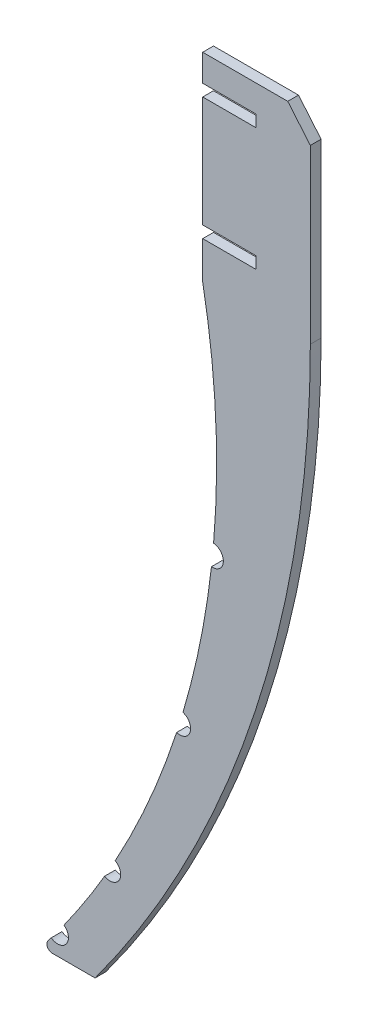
ISO-10303-21;
HEADER;
FILE_DESCRIPTION(('STEP AP214'),'2;1');
FILE_NAME('part.step','',(''),(''),'','','');
FILE_SCHEMA(('AUTOMOTIVE_DESIGN { 1 0 10303 214 1 1 1 1 }'));
ENDSEC;
DATA;
#1=APPLICATION_CONTEXT('core data for automotive mechanical design processes');
#2=APPLICATION_PROTOCOL_DEFINITION('international standard','automotive_design',2000,#1);
#3=PRODUCT_CONTEXT('',#1,'mechanical');
#4=PRODUCT('Part','Part','',(#3));
#5=PRODUCT_RELATED_PRODUCT_CATEGORY('part','',(#4));
#6=PRODUCT_DEFINITION_FORMATION('','',#4);
#7=PRODUCT_DEFINITION_CONTEXT('part definition',#1,'design');
#8=PRODUCT_DEFINITION('design','',#6,#7);
#9=PRODUCT_DEFINITION_SHAPE('','',#8);
#10=(LENGTH_UNIT() NAMED_UNIT(*) SI_UNIT(.MILLI.,.METRE.));
#11=(NAMED_UNIT(*) PLANE_ANGLE_UNIT() SI_UNIT($,.RADIAN.));
#12=(NAMED_UNIT(*) SI_UNIT($,.STERADIAN.) SOLID_ANGLE_UNIT());
#13=UNCERTAINTY_MEASURE_WITH_UNIT(LENGTH_MEASURE(1.E-05),#10,'distance_accuracy_value','');
#14=(GEOMETRIC_REPRESENTATION_CONTEXT(3) GLOBAL_UNCERTAINTY_ASSIGNED_CONTEXT((#13)) GLOBAL_UNIT_ASSIGNED_CONTEXT((#10,
#11,#12)) REPRESENTATION_CONTEXT('',''));
#15=CARTESIAN_POINT('',(0.,0.,0.));
#16=DIRECTION('',(0.,0.,1.));
#17=DIRECTION('',(1.,0.,0.));
#18=AXIS2_PLACEMENT_3D('',#15,#16,#17);
#19=CARTESIAN_POINT('',(-19.9999999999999,-156.8,1.5));
#20=DIRECTION('',(0.,1.,0.));
#21=DIRECTION('',(1.,0.,0.));
#22=AXIS2_PLACEMENT_3D('',#19,#20,#21);
#23=PLANE('',#22);
#24=DIRECTION('',(0.,0.,1.));
#25=VECTOR('',#24,1.);
#26=CARTESIAN_POINT('',(-27.9577727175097,-156.8,1.5));
#27=LINE('',#26,#25);
#28=CARTESIAN_POINT('',(-27.9577727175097,-156.8,-0.5));
#29=VERTEX_POINT('',#28);
#30=CARTESIAN_POINT('',(-27.9577727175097,-156.8,1.5));
#31=VERTEX_POINT('',#30);
#32=EDGE_CURVE('E11',#29,#31,#27,.T.);
#33=ORIENTED_EDGE('',*,*,#32,.F.);
#34=DIRECTION('',(-1.,0.,0.));
#35=VECTOR('',#34,1.);
#36=CARTESIAN_POINT('',(-186.05,-156.8,-0.5));
#37=LINE('',#36,#35);
#38=CARTESIAN_POINT('',(-19.9999999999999,-156.8,-0.5));
#39=VERTEX_POINT('',#38);
#40=EDGE_CURVE('E149',#29,#39,#37,.F.);
#41=ORIENTED_EDGE('',*,*,#40,.T.);
#42=DIRECTION('',(0.,0.,1.));
#43=VECTOR('',#42,1.);
#44=CARTESIAN_POINT('',(-19.9999999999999,-156.8,1.5));
#45=LINE('',#44,#43);
#46=CARTESIAN_POINT('',(-19.9999999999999,-156.8,1.5));
#47=VERTEX_POINT('',#46);
#48=EDGE_CURVE('E44',#39,#47,#45,.T.);
#49=ORIENTED_EDGE('',*,*,#48,.T.);
#50=DIRECTION('',(1.,0.,0.));
#51=VECTOR('',#50,1.);
#52=CARTESIAN_POINT('',(-19.9999999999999,-156.8,1.5));
#53=LINE('',#52,#51);
#54=EDGE_CURVE('E284',#31,#47,#53,.T.);
#55=ORIENTED_EDGE('',*,*,#54,.F.);
#56=EDGE_LOOP('',(#33,#41,#49,#55));
#57=FACE_BOUND('',#56,.T.);
#58=ADVANCED_FACE('F34',(#57),#23,.F.);
#59=CARTESIAN_POINT('',(-186.05,-34.8000000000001,1.5));
#60=DIRECTION('',(0.,0.,1.));
#61=DIRECTION('',(1.,0.,0.));
#62=AXIS2_PLACEMENT_3D('',#59,#60,#61);
#63=CYLINDRICAL_SURFACE('',#62,206.05);
#64=ORIENTED_EDGE('',*,*,#48,.F.);
#65=CARTESIAN_POINT('',(-186.05,-34.8000000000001,-0.5));
#66=DIRECTION('',(0.,0.,1.));
#67=DIRECTION('',(1.,0.,0.));
#68=AXIS2_PLACEMENT_3D('',#65,#66,#67);
#69=CIRCLE('',#68,206.05);
#70=CARTESIAN_POINT('',(20.,-34.8,-0.5));
#71=VERTEX_POINT('',#70);
#72=EDGE_CURVE('E216',#39,#71,#69,.T.);
#73=ORIENTED_EDGE('',*,*,#72,.T.);
#74=DIRECTION('',(0.,0.,1.));
#75=VECTOR('',#74,1.);
#76=CARTESIAN_POINT('',(20.,-34.8,1.5));
#77=LINE('',#76,#75);
#78=CARTESIAN_POINT('',(20.,-34.8,1.5));
#79=VERTEX_POINT('',#78);
#80=EDGE_CURVE('E277',#71,#79,#77,.T.);
#81=ORIENTED_EDGE('',*,*,#80,.T.);
#82=CARTESIAN_POINT('',(-186.05,-34.8000000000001,1.5));
#83=DIRECTION('',(0.,0.,1.));
#84=DIRECTION('',(-1.,0.,0.));
#85=AXIS2_PLACEMENT_3D('',#82,#83,#84);
#86=CIRCLE('',#85,206.05);
#87=EDGE_CURVE('E293',#47,#79,#86,.T.);
#88=ORIENTED_EDGE('',*,*,#87,.F.);
#89=EDGE_LOOP('',(#64,#73,#81,#88));
#90=FACE_BOUND('',#89,.T.);
#91=ADVANCED_FACE('F296',(#90),#63,.T.);
#92=CARTESIAN_POINT('',(20.,2.2,1.5));
#93=DIRECTION('',(-1.,0.,0.));
#94=DIRECTION('',(0.,1.,0.));
#95=AXIS2_PLACEMENT_3D('',#92,#93,#94);
#96=PLANE('',#95);
#97=ORIENTED_EDGE('',*,*,#80,.F.);
#98=DIRECTION('',(0.,1.,0.));
#99=VECTOR('',#98,1.);
#100=CARTESIAN_POINT('',(20.,-34.8000000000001,-0.5));
#101=LINE('',#100,#99);
#102=CARTESIAN_POINT('',(20.,-2.80000000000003,-0.5));
#103=VERTEX_POINT('',#102);
#104=EDGE_CURVE('E213',#71,#103,#101,.T.);
#105=ORIENTED_EDGE('',*,*,#104,.T.);
#106=DIRECTION('',(0.,0.,1.));
#107=VECTOR('',#106,1.);
#108=CARTESIAN_POINT('',(20.,-2.80000000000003,1.5));
#109=LINE('',#108,#107);
#110=CARTESIAN_POINT('',(20.,-2.80000000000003,1.5));
#111=VERTEX_POINT('',#110);
#112=EDGE_CURVE('E274',#103,#111,#109,.T.);
#113=ORIENTED_EDGE('',*,*,#112,.T.);
#114=DIRECTION('',(0.,1.,0.));
#115=VECTOR('',#114,1.);
#116=CARTESIAN_POINT('',(20.,2.2,1.5));
#117=LINE('',#116,#115);
#118=EDGE_CURVE('E297',#79,#111,#117,.T.);
#119=ORIENTED_EDGE('',*,*,#118,.F.);
#120=EDGE_LOOP('',(#97,#105,#113,#119));
#121=FACE_BOUND('',#120,.T.);
#122=ADVANCED_FACE('F464',(#121),#96,.F.);
#123=CARTESIAN_POINT('',(15.8045018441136,2.2,1.5));
#124=DIRECTION('',(0.76604444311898,0.642787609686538,0.));
#125=DIRECTION('',(0.642787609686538,-0.76604444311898,0.));
#126=AXIS2_PLACEMENT_3D('',#123,#124,#125);
#127=PLANE('',#126);
#128=ORIENTED_EDGE('',*,*,#112,.F.);
#129=DIRECTION('',(0.642787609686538,-0.76604444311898,0.));
#130=VECTOR('',#129,1.);
#131=CARTESIAN_POINT('',(15.8045018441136,2.2,-0.5));
#132=LINE('',#131,#130);
#133=CARTESIAN_POINT('',(15.8045018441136,2.2,-0.5));
#134=VERTEX_POINT('',#133);
#135=EDGE_CURVE('E210',#103,#134,#132,.F.);
#136=ORIENTED_EDGE('',*,*,#135,.T.);
#137=DIRECTION('',(0.,0.,1.));
#138=VECTOR('',#137,1.);
#139=CARTESIAN_POINT('',(15.8045018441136,2.2,1.5));
#140=LINE('',#139,#138);
#141=CARTESIAN_POINT('',(15.8045018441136,2.2,1.5));
#142=VERTEX_POINT('',#141);
#143=EDGE_CURVE('E271',#134,#142,#140,.T.);
#144=ORIENTED_EDGE('',*,*,#143,.T.);
#145=DIRECTION('',(0.642787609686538,-0.76604444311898,0.));
#146=VECTOR('',#145,1.);
#147=CARTESIAN_POINT('',(15.8045018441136,2.2,1.5));
#148=LINE('',#147,#146);
#149=EDGE_CURVE('E299',#111,#142,#148,.F.);
#150=ORIENTED_EDGE('',*,*,#149,.F.);
#151=EDGE_LOOP('',(#128,#136,#144,#150));
#152=FACE_BOUND('',#151,.T.);
#153=ADVANCED_FACE('F460',(#152),#127,.T.);
#154=CARTESIAN_POINT('',(0.,2.2,1.5));
#155=DIRECTION('',(0.,-1.,0.));
#156=DIRECTION('',(-1.,0.,0.));
#157=AXIS2_PLACEMENT_3D('',#154,#155,#156);
#158=PLANE('',#157);
#159=ORIENTED_EDGE('',*,*,#143,.F.);
#160=DIRECTION('',(-1.,0.,0.));
#161=VECTOR('',#160,1.);
#162=CARTESIAN_POINT('',(-186.05,2.2,-0.5));
#163=LINE('',#162,#161);
#164=CARTESIAN_POINT('',(0.,2.2,-0.5));
#165=VERTEX_POINT('',#164);
#166=EDGE_CURVE('E207',#134,#165,#163,.T.);
#167=ORIENTED_EDGE('',*,*,#166,.T.);
#168=DIRECTION('',(0.,0.,1.));
#169=VECTOR('',#168,1.);
#170=CARTESIAN_POINT('',(0.,2.2,1.5));
#171=LINE('',#170,#169);
#172=CARTESIAN_POINT('',(0.,2.2,1.5));
#173=VERTEX_POINT('',#172);
#174=EDGE_CURVE('E268',#165,#173,#171,.T.);
#175=ORIENTED_EDGE('',*,*,#174,.T.);
#176=DIRECTION('',(-1.,0.,0.));
#177=VECTOR('',#176,1.);
#178=CARTESIAN_POINT('',(0.,2.2,1.5));
#179=LINE('',#178,#177);
#180=EDGE_CURVE('E305',#142,#173,#179,.T.);
#181=ORIENTED_EDGE('',*,*,#180,.F.);
#182=EDGE_LOOP('',(#159,#167,#175,#181));
#183=FACE_BOUND('',#182,.T.);
#184=ADVANCED_FACE('F457',(#183),#158,.F.);
#185=CARTESIAN_POINT('',(0.,-2.8,1.5));
#186=DIRECTION('',(1.,0.,0.));
#187=DIRECTION('',(0.,-1.,0.));
#188=AXIS2_PLACEMENT_3D('',#185,#186,#187);
#189=PLANE('',#188);
#190=ORIENTED_EDGE('',*,*,#174,.F.);
#191=DIRECTION('',(0.,1.,0.));
#192=VECTOR('',#191,1.);
#193=CARTESIAN_POINT('',(0.,-34.8000000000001,-0.5));
#194=LINE('',#193,#192);
#195=CARTESIAN_POINT('',(0.,-2.8,-0.5));
#196=VERTEX_POINT('',#195);
#197=EDGE_CURVE('E204',#165,#196,#194,.F.);
#198=ORIENTED_EDGE('',*,*,#197,.T.);
#199=DIRECTION('',(0.,0.,1.));
#200=VECTOR('',#199,1.);
#201=CARTESIAN_POINT('',(0.,-2.8,1.5));
#202=LINE('',#201,#200);
#203=CARTESIAN_POINT('',(0.,-2.8,1.5));
#204=VERTEX_POINT('',#203);
#205=EDGE_CURVE('E265',#196,#204,#202,.T.);
#206=ORIENTED_EDGE('',*,*,#205,.T.);
#207=DIRECTION('',(0.,-1.,0.));
#208=VECTOR('',#207,1.);
#209=CARTESIAN_POINT('',(0.,-2.8,1.5));
#210=LINE('',#209,#208);
#211=EDGE_CURVE('E308',#173,#204,#210,.T.);
#212=ORIENTED_EDGE('',*,*,#211,.F.);
#213=EDGE_LOOP('',(#190,#198,#206,#212));
#214=FACE_BOUND('',#213,.T.);
#215=ADVANCED_FACE('F454',(#214),#189,.F.);
#216=CARTESIAN_POINT('',(0.,-2.8,1.5));
#217=DIRECTION('',(0.,1.,0.));
#218=DIRECTION('',(1.,0.,0.));
#219=AXIS2_PLACEMENT_3D('',#216,#217,#218);
#220=PLANE('',#219);
#221=ORIENTED_EDGE('',*,*,#205,.F.);
#222=DIRECTION('',(-1.,0.,0.));
#223=VECTOR('',#222,1.);
#224=CARTESIAN_POINT('',(-186.05,-2.8,-0.5));
#225=LINE('',#224,#223);
#226=CARTESIAN_POINT('',(9.91,-2.8,-0.5));
#227=VERTEX_POINT('',#226);
#228=EDGE_CURVE('E201',#196,#227,#225,.F.);
#229=ORIENTED_EDGE('',*,*,#228,.T.);
#230=DIRECTION('',(0.,0.,1.));
#231=VECTOR('',#230,1.);
#232=CARTESIAN_POINT('',(9.91,-2.8,1.5));
#233=LINE('',#232,#231);
#234=CARTESIAN_POINT('',(9.91,-2.8,1.5));
#235=VERTEX_POINT('',#234);
#236=EDGE_CURVE('E262',#227,#235,#233,.T.);
#237=ORIENTED_EDGE('',*,*,#236,.T.);
#238=DIRECTION('',(1.,0.,0.));
#239=VECTOR('',#238,1.);
#240=CARTESIAN_POINT('',(0.,-2.8,1.5));
#241=LINE('',#240,#239);
#242=EDGE_CURVE('E311',#204,#235,#241,.T.);
#243=ORIENTED_EDGE('',*,*,#242,.F.);
#244=EDGE_LOOP('',(#221,#229,#237,#243));
#245=FACE_BOUND('',#244,.T.);
#246=ADVANCED_FACE('F449',(#245),#220,.F.);
#247=CARTESIAN_POINT('',(9.91,-2.8,1.5));
#248=DIRECTION('',(1.,0.,0.));
#249=DIRECTION('',(0.,-1.,0.));
#250=AXIS2_PLACEMENT_3D('',#247,#248,#249);
#251=PLANE('',#250);
#252=ORIENTED_EDGE('',*,*,#236,.F.);
#253=DIRECTION('',(0.,1.,0.));
#254=VECTOR('',#253,1.);
#255=CARTESIAN_POINT('',(9.91,-34.8000000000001,-0.5));
#256=LINE('',#255,#254);
#257=CARTESIAN_POINT('',(9.91,-5.,-0.5));
#258=VERTEX_POINT('',#257);
#259=EDGE_CURVE('E198',#227,#258,#256,.F.);
#260=ORIENTED_EDGE('',*,*,#259,.T.);
#261=DIRECTION('',(0.,0.,1.));
#262=VECTOR('',#261,1.);
#263=CARTESIAN_POINT('',(9.91,-5.,1.5));
#264=LINE('',#263,#262);
#265=CARTESIAN_POINT('',(9.91,-5.,1.5));
#266=VERTEX_POINT('',#265);
#267=EDGE_CURVE('E259',#258,#266,#264,.T.);
#268=ORIENTED_EDGE('',*,*,#267,.T.);
#269=DIRECTION('',(0.,-1.,0.));
#270=VECTOR('',#269,1.);
#271=CARTESIAN_POINT('',(9.91,-2.8,1.5));
#272=LINE('',#271,#270);
#273=EDGE_CURVE('E314',#235,#266,#272,.T.);
#274=ORIENTED_EDGE('',*,*,#273,.F.);
#275=EDGE_LOOP('',(#252,#260,#268,#274));
#276=FACE_BOUND('',#275,.T.);
#277=ADVANCED_FACE('F445',(#276),#251,.F.);
#278=CARTESIAN_POINT('',(0.,-5.,1.5));
#279=DIRECTION('',(0.,-1.,0.));
#280=DIRECTION('',(-1.,0.,0.));
#281=AXIS2_PLACEMENT_3D('',#278,#279,#280);
#282=PLANE('',#281);
#283=ORIENTED_EDGE('',*,*,#267,.F.);
#284=DIRECTION('',(-1.,0.,0.));
#285=VECTOR('',#284,1.);
#286=CARTESIAN_POINT('',(-186.05,-5.,-0.5));
#287=LINE('',#286,#285);
#288=CARTESIAN_POINT('',(0.,-5.,-0.5));
#289=VERTEX_POINT('',#288);
#290=EDGE_CURVE('E195',#258,#289,#287,.T.);
#291=ORIENTED_EDGE('',*,*,#290,.T.);
#292=DIRECTION('',(0.,0.,1.));
#293=VECTOR('',#292,1.);
#294=CARTESIAN_POINT('',(0.,-5.,1.5));
#295=LINE('',#294,#293);
#296=CARTESIAN_POINT('',(0.,-5.,1.5));
#297=VERTEX_POINT('',#296);
#298=EDGE_CURVE('E256',#289,#297,#295,.T.);
#299=ORIENTED_EDGE('',*,*,#298,.T.);
#300=DIRECTION('',(-1.,0.,0.));
#301=VECTOR('',#300,1.);
#302=CARTESIAN_POINT('',(0.,-5.,1.5));
#303=LINE('',#302,#301);
#304=EDGE_CURVE('E317',#266,#297,#303,.T.);
#305=ORIENTED_EDGE('',*,*,#304,.F.);
#306=EDGE_LOOP('',(#283,#291,#299,#305));
#307=FACE_BOUND('',#306,.T.);
#308=ADVANCED_FACE('F442',(#307),#282,.F.);
#309=CARTESIAN_POINT('',(0.,-5.,1.5));
#310=DIRECTION('',(1.,0.,0.));
#311=DIRECTION('',(0.,-1.,0.));
#312=AXIS2_PLACEMENT_3D('',#309,#310,#311);
#313=PLANE('',#312);
#314=ORIENTED_EDGE('',*,*,#298,.F.);
#315=DIRECTION('',(0.,1.,0.));
#316=VECTOR('',#315,1.);
#317=CARTESIAN_POINT('',(0.,-34.8000000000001,-0.5));
#318=LINE('',#317,#316);
#319=CARTESIAN_POINT('',(0.,-25.6,-0.5));
#320=VERTEX_POINT('',#319);
#321=EDGE_CURVE('E192',#289,#320,#318,.F.);
#322=ORIENTED_EDGE('',*,*,#321,.T.);
#323=DIRECTION('',(0.,0.,1.));
#324=VECTOR('',#323,1.);
#325=CARTESIAN_POINT('',(0.,-25.6,1.5));
#326=LINE('',#325,#324);
#327=CARTESIAN_POINT('',(0.,-25.6,1.5));
#328=VERTEX_POINT('',#327);
#329=EDGE_CURVE('E253',#320,#328,#326,.T.);
#330=ORIENTED_EDGE('',*,*,#329,.T.);
#331=DIRECTION('',(0.,-1.,0.));
#332=VECTOR('',#331,1.);
#333=CARTESIAN_POINT('',(0.,-5.,1.5));
#334=LINE('',#333,#332);
#335=EDGE_CURVE('E320',#297,#328,#334,.T.);
#336=ORIENTED_EDGE('',*,*,#335,.F.);
#337=EDGE_LOOP('',(#314,#322,#330,#336));
#338=FACE_BOUND('',#337,.T.);
#339=ADVANCED_FACE('F437',(#338),#313,.F.);
#340=CARTESIAN_POINT('',(0.,-25.6,1.5));
#341=DIRECTION('',(0.,1.,0.));
#342=DIRECTION('',(1.,0.,0.));
#343=AXIS2_PLACEMENT_3D('',#340,#341,#342);
#344=PLANE('',#343);
#345=ORIENTED_EDGE('',*,*,#329,.F.);
#346=DIRECTION('',(-1.,0.,0.));
#347=VECTOR('',#346,1.);
#348=CARTESIAN_POINT('',(-186.05,-25.6,-0.5));
#349=LINE('',#348,#347);
#350=CARTESIAN_POINT('',(9.91,-25.6,-0.5));
#351=VERTEX_POINT('',#350);
#352=EDGE_CURVE('E189',#320,#351,#349,.F.);
#353=ORIENTED_EDGE('',*,*,#352,.T.);
#354=DIRECTION('',(0.,0.,1.));
#355=VECTOR('',#354,1.);
#356=CARTESIAN_POINT('',(9.91,-25.6,1.5));
#357=LINE('',#356,#355);
#358=CARTESIAN_POINT('',(9.91,-25.6,1.5));
#359=VERTEX_POINT('',#358);
#360=EDGE_CURVE('E250',#351,#359,#357,.T.);
#361=ORIENTED_EDGE('',*,*,#360,.T.);
#362=DIRECTION('',(1.,0.,0.));
#363=VECTOR('',#362,1.);
#364=CARTESIAN_POINT('',(0.,-25.6,1.5));
#365=LINE('',#364,#363);
#366=EDGE_CURVE('E323',#328,#359,#365,.T.);
#367=ORIENTED_EDGE('',*,*,#366,.F.);
#368=EDGE_LOOP('',(#345,#353,#361,#367));
#369=FACE_BOUND('',#368,.T.);
#370=ADVANCED_FACE('F433',(#369),#344,.F.);
#371=CARTESIAN_POINT('',(9.91,-25.6,1.5));
#372=DIRECTION('',(1.,0.,0.));
#373=DIRECTION('',(0.,-1.,0.));
#374=AXIS2_PLACEMENT_3D('',#371,#372,#373);
#375=PLANE('',#374);
#376=ORIENTED_EDGE('',*,*,#360,.F.);
#377=DIRECTION('',(0.,1.,0.));
#378=VECTOR('',#377,1.);
#379=CARTESIAN_POINT('',(9.91,-34.8000000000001,-0.5));
#380=LINE('',#379,#378);
#381=CARTESIAN_POINT('',(9.91,-27.8,-0.5));
#382=VERTEX_POINT('',#381);
#383=EDGE_CURVE('E186',#351,#382,#380,.F.);
#384=ORIENTED_EDGE('',*,*,#383,.T.);
#385=DIRECTION('',(0.,0.,1.));
#386=VECTOR('',#385,1.);
#387=CARTESIAN_POINT('',(9.91,-27.8,1.5));
#388=LINE('',#387,#386);
#389=CARTESIAN_POINT('',(9.91,-27.8,1.5));
#390=VERTEX_POINT('',#389);
#391=EDGE_CURVE('E247',#382,#390,#388,.T.);
#392=ORIENTED_EDGE('',*,*,#391,.T.);
#393=DIRECTION('',(0.,-1.,0.));
#394=VECTOR('',#393,1.);
#395=CARTESIAN_POINT('',(9.91,-25.6,1.5));
#396=LINE('',#395,#394);
#397=EDGE_CURVE('E326',#359,#390,#396,.T.);
#398=ORIENTED_EDGE('',*,*,#397,.F.);
#399=EDGE_LOOP('',(#376,#384,#392,#398));
#400=FACE_BOUND('',#399,.T.);
#401=ADVANCED_FACE('F430',(#400),#375,.F.);
#402=CARTESIAN_POINT('',(0.,-27.8,1.5));
#403=DIRECTION('',(0.,-1.,0.));
#404=DIRECTION('',(-1.,0.,0.));
#405=AXIS2_PLACEMENT_3D('',#402,#403,#404);
#406=PLANE('',#405);
#407=ORIENTED_EDGE('',*,*,#391,.F.);
#408=DIRECTION('',(-1.,0.,0.));
#409=VECTOR('',#408,1.);
#410=CARTESIAN_POINT('',(-186.05,-27.8,-0.5));
#411=LINE('',#410,#409);
#412=CARTESIAN_POINT('',(0.,-27.8,-0.5));
#413=VERTEX_POINT('',#412);
#414=EDGE_CURVE('E183',#382,#413,#411,.T.);
#415=ORIENTED_EDGE('',*,*,#414,.T.);
#416=DIRECTION('',(0.,0.,1.));
#417=VECTOR('',#416,1.);
#418=CARTESIAN_POINT('',(0.,-27.8,1.5));
#419=LINE('',#418,#417);
#420=CARTESIAN_POINT('',(0.,-27.8,1.5));
#421=VERTEX_POINT('',#420);
#422=EDGE_CURVE('E244',#413,#421,#419,.T.);
#423=ORIENTED_EDGE('',*,*,#422,.T.);
#424=DIRECTION('',(-1.,0.,0.));
#425=VECTOR('',#424,1.);
#426=CARTESIAN_POINT('',(0.,-27.8,1.5));
#427=LINE('',#426,#425);
#428=EDGE_CURVE('E329',#390,#421,#427,.T.);
#429=ORIENTED_EDGE('',*,*,#428,.F.);
#430=EDGE_LOOP('',(#407,#415,#423,#429));
#431=FACE_BOUND('',#430,.T.);
#432=ADVANCED_FACE('F425',(#431),#406,.F.);
#433=CARTESIAN_POINT('',(0.,-27.8,1.5));
#434=DIRECTION('',(1.,0.,0.));
#435=DIRECTION('',(0.,-1.,0.));
#436=AXIS2_PLACEMENT_3D('',#433,#434,#435);
#437=PLANE('',#436);
#438=ORIENTED_EDGE('',*,*,#422,.F.);
#439=DIRECTION('',(0.,1.,0.));
#440=VECTOR('',#439,1.);
#441=CARTESIAN_POINT('',(0.,-34.8000000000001,-0.5));
#442=LINE('',#441,#440);
#443=CARTESIAN_POINT('',(0.,-34.8,-0.5));
#444=VERTEX_POINT('',#443);
#445=EDGE_CURVE('E180',#413,#444,#442,.F.);
#446=ORIENTED_EDGE('',*,*,#445,.T.);
#447=DIRECTION('',(0.,0.,1.));
#448=VECTOR('',#447,1.);
#449=CARTESIAN_POINT('',(0.,-34.8,1.5));
#450=LINE('',#449,#448);
#451=CARTESIAN_POINT('',(0.,-34.8,1.5));
#452=VERTEX_POINT('',#451);
#453=EDGE_CURVE('E241',#444,#452,#450,.T.);
#454=ORIENTED_EDGE('',*,*,#453,.T.);
#455=DIRECTION('',(0.,-1.,0.));
#456=VECTOR('',#455,1.);
#457=CARTESIAN_POINT('',(0.,-27.8,1.5));
#458=LINE('',#457,#456);
#459=EDGE_CURVE('E332',#421,#452,#458,.T.);
#460=ORIENTED_EDGE('',*,*,#459,.F.);
#461=EDGE_LOOP('',(#438,#446,#454,#460));
#462=FACE_BOUND('',#461,.T.);
#463=ADVANCED_FACE('F421',(#462),#437,.F.);
#464=CARTESIAN_POINT('',(-149.53282032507,-62.7181589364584,1.5));
#465=DIRECTION('',(0.,0.,-1.));
#466=DIRECTION('',(-1.,0.,0.));
#467=AXIS2_PLACEMENT_3D('',#464,#465,#466);
#468=CYLINDRICAL_SURFACE('',#467,152.11669189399);
#469=ORIENTED_EDGE('',*,*,#453,.F.);
#470=CARTESIAN_POINT('',(-149.53282032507,-62.7181589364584,-0.5));
#471=DIRECTION('',(0.,0.,-1.));
#472=DIRECTION('',(-1.,0.,0.));
#473=AXIS2_PLACEMENT_3D('',#470,#471,#472);
#474=CIRCLE('',#473,152.11669189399);
#475=CARTESIAN_POINT('',(2.01957480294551,-75.8085937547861,-0.5));
#476=VERTEX_POINT('',#475);
#477=EDGE_CURVE('E177',#444,#476,#474,.T.);
#478=ORIENTED_EDGE('',*,*,#477,.T.);
#479=DIRECTION('',(0.,0.,1.));
#480=VECTOR('',#479,1.);
#481=CARTESIAN_POINT('',(2.01957480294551,-75.8085937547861,1.5));
#482=LINE('',#481,#480);
#483=CARTESIAN_POINT('',(2.01957480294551,-75.8085937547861,1.5));
#484=VERTEX_POINT('',#483);
#485=EDGE_CURVE('E238',#476,#484,#482,.T.);
#486=ORIENTED_EDGE('',*,*,#485,.T.);
#487=CARTESIAN_POINT('',(-149.53282032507,-62.7181589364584,1.5));
#488=DIRECTION('',(0.,0.,-1.));
#489=DIRECTION('',(-1.,0.,0.));
#490=AXIS2_PLACEMENT_3D('',#487,#488,#489);
#491=CIRCLE('',#490,152.11669189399);
#492=EDGE_CURVE('E335',#452,#484,#491,.T.);
#493=ORIENTED_EDGE('',*,*,#492,.F.);
#494=EDGE_LOOP('',(#469,#478,#486,#493));
#495=FACE_BOUND('',#494,.T.);
#496=ADVANCED_FACE('F418',(#495),#468,.F.);
#497=CARTESIAN_POINT('',(1.83436906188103,-77.8,1.5));
#498=DIRECTION('',(0.,0.,1.));
#499=DIRECTION('',(1.,0.,0.));
#500=AXIS2_PLACEMENT_3D('',#497,#498,#499);
#501=CYLINDRICAL_SURFACE('',#500,2.);
#502=ORIENTED_EDGE('',*,*,#485,.F.);
#503=CARTESIAN_POINT('',(1.83436906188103,-77.8,-0.5));
#504=DIRECTION('',(0.,0.,1.));
#505=DIRECTION('',(1.,0.,0.));
#506=AXIS2_PLACEMENT_3D('',#503,#504,#505);
#507=CIRCLE('',#506,2.);
#508=CARTESIAN_POINT('',(1.62299728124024,-79.7887991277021,-0.5));
#509=VERTEX_POINT('',#508);
#510=EDGE_CURVE('E174',#509,#476,#507,.T.);
#511=ORIENTED_EDGE('',*,*,#510,.F.);
#512=DIRECTION('',(0.,0.,1.));
#513=VECTOR('',#512,1.);
#514=CARTESIAN_POINT('',(1.62299728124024,-79.7887991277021,1.5));
#515=LINE('',#514,#513);
#516=CARTESIAN_POINT('',(1.62299728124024,-79.7887991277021,1.5));
#517=VERTEX_POINT('',#516);
#518=EDGE_CURVE('E235',#509,#517,#515,.T.);
#519=ORIENTED_EDGE('',*,*,#518,.T.);
#520=CARTESIAN_POINT('',(1.83436906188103,-77.8,1.5));
#521=DIRECTION('',(0.,0.,1.));
#522=DIRECTION('',(1.,0.,0.));
#523=AXIS2_PLACEMENT_3D('',#520,#521,#522);
#524=CIRCLE('',#523,2.);
#525=EDGE_CURVE('E336',#517,#484,#524,.T.);
#526=ORIENTED_EDGE('',*,*,#525,.T.);
#527=EDGE_LOOP('',(#502,#511,#519,#526));
#528=FACE_BOUND('',#527,.T.);
#529=ADVANCED_FACE('F414',(#528),#501,.F.);
#530=ORIENTED_EDGE('',*,*,#518,.F.);
#531=CARTESIAN_POINT('',(-149.53282032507,-62.7181589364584,-0.5));
#532=DIRECTION('',(0.,0.,-1.));
#533=DIRECTION('',(-1.,0.,0.));
#534=AXIS2_PLACEMENT_3D('',#531,#532,#533);
#535=CIRCLE('',#534,152.11669189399);
#536=CARTESIAN_POINT('',(-3.66978203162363,-105.885994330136,-0.5));
#537=VERTEX_POINT('',#536);
#538=EDGE_CURVE('E171',#509,#537,#535,.T.);
#539=ORIENTED_EDGE('',*,*,#538,.T.);
#540=DIRECTION('',(0.,0.,1.));
#541=VECTOR('',#540,1.);
#542=CARTESIAN_POINT('',(-3.66978203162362,-105.885994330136,1.5));
#543=LINE('',#542,#541);
#544=CARTESIAN_POINT('',(-3.66978203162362,-105.885994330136,1.5));
#545=VERTEX_POINT('',#544);
#546=EDGE_CURVE('E232',#537,#545,#543,.T.);
#547=ORIENTED_EDGE('',*,*,#546,.T.);
#548=EDGE_CURVE('E339',#517,#545,#491,.T.);
#549=ORIENTED_EDGE('',*,*,#548,.F.);
#550=EDGE_LOOP('',(#530,#539,#547,#549));
#551=FACE_BOUND('',#550,.T.);
#552=ADVANCED_FACE('F412',(#551),#468,.F.);
#553=CARTESIAN_POINT('',(-4.24993916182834,-107.8,1.5));
#554=DIRECTION('',(0.,0.,1.));
#555=DIRECTION('',(1.,0.,0.));
#556=AXIS2_PLACEMENT_3D('',#553,#554,#555);
#557=CYLINDRICAL_SURFACE('',#556,2.);
#558=ORIENTED_EDGE('',*,*,#546,.F.);
#559=CARTESIAN_POINT('',(-4.24993916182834,-107.8,-0.5));
#560=DIRECTION('',(0.,0.,1.));
#561=DIRECTION('',(1.,0.,0.));
#562=AXIS2_PLACEMENT_3D('',#559,#560,#561);
#563=CIRCLE('',#562,2.);
#564=CARTESIAN_POINT('',(-4.85521056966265,-109.706212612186,-0.5));
#565=VERTEX_POINT('',#564);
#566=EDGE_CURVE('E168',#565,#537,#563,.T.);
#567=ORIENTED_EDGE('',*,*,#566,.F.);
#568=DIRECTION('',(0.,0.,1.));
#569=VECTOR('',#568,1.);
#570=CARTESIAN_POINT('',(-4.85521056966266,-109.706212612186,1.5));
#571=LINE('',#570,#569);
#572=CARTESIAN_POINT('',(-4.85521056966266,-109.706212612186,1.5));
#573=VERTEX_POINT('',#572);
#574=EDGE_CURVE('E229',#565,#573,#571,.T.);
#575=ORIENTED_EDGE('',*,*,#574,.T.);
#576=CARTESIAN_POINT('',(-4.24993916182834,-107.8,1.5));
#577=DIRECTION('',(0.,0.,1.));
#578=DIRECTION('',(1.,0.,0.));
#579=AXIS2_PLACEMENT_3D('',#576,#577,#578);
#580=CIRCLE('',#579,2.);
#581=EDGE_CURVE('E340',#573,#545,#580,.T.);
#582=ORIENTED_EDGE('',*,*,#581,.T.);
#583=EDGE_LOOP('',(#558,#567,#575,#582));
#584=FACE_BOUND('',#583,.T.);
#585=ADVANCED_FACE('F408',(#584),#557,.F.);
#586=ORIENTED_EDGE('',*,*,#574,.F.);
#587=CARTESIAN_POINT('',(-149.53282032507,-62.7181589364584,-0.5));
#588=DIRECTION('',(0.,0.,-1.));
#589=DIRECTION('',(-1.,0.,0.));
#590=AXIS2_PLACEMENT_3D('',#587,#588,#589);
#591=CIRCLE('',#590,152.11669189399);
#592=CARTESIAN_POINT('',(-16.261215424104,-136.054147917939,-0.5));
#593=VERTEX_POINT('',#592);
#594=EDGE_CURVE('E165',#565,#593,#591,.T.);
#595=ORIENTED_EDGE('',*,*,#594,.T.);
#596=DIRECTION('',(0.,0.,1.));
#597=VECTOR('',#596,1.);
#598=CARTESIAN_POINT('',(-16.261215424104,-136.054147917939,1.5));
#599=LINE('',#598,#597);
#600=CARTESIAN_POINT('',(-16.261215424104,-136.054147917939,1.5));
#601=VERTEX_POINT('',#600);
#602=EDGE_CURVE('E226',#593,#601,#599,.T.);
#603=ORIENTED_EDGE('',*,*,#602,.T.);
#604=EDGE_CURVE('E342',#573,#601,#491,.T.);
#605=ORIENTED_EDGE('',*,*,#604,.F.);
#606=EDGE_LOOP('',(#586,#595,#603,#605));
#607=FACE_BOUND('',#606,.T.);
#608=ADVANCED_FACE('F406',(#607),#468,.F.);
#609=CARTESIAN_POINT('',(-17.2369205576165,-137.8,1.5));
#610=DIRECTION('',(0.,0.,1.));
#611=DIRECTION('',(1.,0.,0.));
#612=AXIS2_PLACEMENT_3D('',#609,#610,#611);
#613=CYLINDRICAL_SURFACE('',#612,2.);
#614=ORIENTED_EDGE('',*,*,#602,.F.);
#615=CARTESIAN_POINT('',(-17.2369205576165,-137.8,-0.5));
#616=DIRECTION('',(0.,0.,1.));
#617=DIRECTION('',(1.,0.,0.));
#618=AXIS2_PLACEMENT_3D('',#615,#616,#617);
#619=CIRCLE('',#618,2.);
#620=CARTESIAN_POINT('',(-18.2354949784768,-139.532873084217,-0.5));
#621=VERTEX_POINT('',#620);
#622=EDGE_CURVE('E162',#621,#593,#619,.T.);
#623=ORIENTED_EDGE('',*,*,#622,.F.);
#624=DIRECTION('',(0.,0.,1.));
#625=VECTOR('',#624,1.);
#626=CARTESIAN_POINT('',(-18.2354949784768,-139.532873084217,1.5));
#627=LINE('',#626,#625);
#628=CARTESIAN_POINT('',(-18.2354949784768,-139.532873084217,1.5));
#629=VERTEX_POINT('',#628);
#630=EDGE_CURVE('E223',#621,#629,#627,.T.);
#631=ORIENTED_EDGE('',*,*,#630,.T.);
#632=CARTESIAN_POINT('',(-17.2369205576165,-137.8,1.5));
#633=DIRECTION('',(0.,0.,1.));
#634=DIRECTION('',(1.,0.,0.));
#635=AXIS2_PLACEMENT_3D('',#632,#633,#634);
#636=CIRCLE('',#635,2.);
#637=EDGE_CURVE('E343',#629,#601,#636,.T.);
#638=ORIENTED_EDGE('',*,*,#637,.T.);
#639=EDGE_LOOP('',(#614,#623,#631,#638));
#640=FACE_BOUND('',#639,.T.);
#641=ADVANCED_FACE('F397',(#640),#613,.F.);
#642=ORIENTED_EDGE('',*,*,#630,.F.);
#643=CARTESIAN_POINT('',(-149.53282032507,-62.7181589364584,-0.5));
#644=DIRECTION('',(0.,0.,-1.));
#645=DIRECTION('',(-1.,0.,0.));
#646=AXIS2_PLACEMENT_3D('',#643,#644,#645);
#647=CIRCLE('',#646,152.11669189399);
#648=CARTESIAN_POINT('',(-25.783575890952,-151.18065073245,-0.5));
#649=VERTEX_POINT('',#648);
#650=EDGE_CURVE('E159',#621,#649,#647,.T.);
#651=ORIENTED_EDGE('',*,*,#650,.T.);
#652=DIRECTION('',(0.,0.,1.));
#653=VECTOR('',#652,1.);
#654=CARTESIAN_POINT('',(-25.783575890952,-151.18065073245,1.5));
#655=LINE('',#654,#653);
#656=CARTESIAN_POINT('',(-25.783575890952,-151.18065073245,1.5));
#657=VERTEX_POINT('',#656);
#658=EDGE_CURVE('E221',#649,#657,#655,.T.);
#659=ORIENTED_EDGE('',*,*,#658,.T.);
#660=EDGE_CURVE('E345',#629,#657,#491,.T.);
#661=ORIENTED_EDGE('',*,*,#660,.F.);
#662=EDGE_LOOP('',(#642,#651,#659,#661));
#663=FACE_BOUND('',#662,.T.);
#664=ADVANCED_FACE('F401',(#663),#468,.F.);
#665=CARTESIAN_POINT('',(-26.9573339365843,-152.8,1.5));
#666=DIRECTION('',(0.,0.,1.));
#667=DIRECTION('',(1.,0.,0.));
#668=AXIS2_PLACEMENT_3D('',#665,#666,#667);
#669=CYLINDRICAL_SURFACE('',#668,2.);
#670=ORIENTED_EDGE('',*,*,#658,.F.);
#671=CARTESIAN_POINT('',(-26.9573339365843,-152.8,-0.5));
#672=DIRECTION('',(0.,0.,1.));
#673=DIRECTION('',(1.,0.,0.));
#674=AXIS2_PLACEMENT_3D('',#671,#672,#673);
#675=CIRCLE('',#674,2.);
#676=CARTESIAN_POINT('',(-28.1522809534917,-154.403777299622,-0.5));
#677=VERTEX_POINT('',#676);
#678=EDGE_CURVE('E156',#677,#649,#675,.T.);
#679=ORIENTED_EDGE('',*,*,#678,.F.);
#680=DIRECTION('',(0.,0.,1.));
#681=VECTOR('',#680,1.);
#682=CARTESIAN_POINT('',(-28.1522809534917,-154.403777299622,1.5));
#683=LINE('',#682,#681);
#684=CARTESIAN_POINT('',(-28.1522809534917,-154.403777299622,1.5));
#685=VERTEX_POINT('',#684);
#686=EDGE_CURVE('E52',#677,#685,#683,.T.);
#687=ORIENTED_EDGE('',*,*,#686,.T.);
#688=CARTESIAN_POINT('',(-26.9573339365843,-152.8,1.5));
#689=DIRECTION('',(0.,0.,1.));
#690=DIRECTION('',(1.,0.,0.));
#691=AXIS2_PLACEMENT_3D('',#688,#689,#690);
#692=CIRCLE('',#691,2.);
#693=EDGE_CURVE('E142',#685,#657,#692,.T.);
#694=ORIENTED_EDGE('',*,*,#693,.T.);
#695=EDGE_LOOP('',(#670,#679,#687,#694));
#696=FACE_BOUND('',#695,.T.);
#697=ADVANCED_FACE('F402',(#696),#669,.F.);
#698=ORIENTED_EDGE('',*,*,#686,.F.);
#699=CARTESIAN_POINT('',(-149.53282032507,-62.7181589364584,-0.5));
#700=DIRECTION('',(0.,0.,-1.));
#701=DIRECTION('',(-1.,0.,0.));
#702=AXIS2_PLACEMENT_3D('',#699,#700,#701);
#703=CIRCLE('',#702,152.11669189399);
#704=CARTESIAN_POINT('',(-28.7517752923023,-155.19208560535,-0.5));
#705=VERTEX_POINT('',#704);
#706=EDGE_CURVE('E147',#677,#705,#703,.T.);
#707=ORIENTED_EDGE('',*,*,#706,.T.);
#708=DIRECTION('',(0.,0.,1.));
#709=VECTOR('',#708,1.);
#710=CARTESIAN_POINT('',(-28.7517752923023,-155.19208560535,1.5));
#711=LINE('',#710,#709);
#712=CARTESIAN_POINT('',(-28.7517752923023,-155.19208560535,1.5));
#713=VERTEX_POINT('',#712);
#714=EDGE_CURVE('E38',#705,#713,#711,.T.);
#715=ORIENTED_EDGE('',*,*,#714,.T.);
#716=EDGE_CURVE('E158',#685,#713,#491,.T.);
#717=ORIENTED_EDGE('',*,*,#716,.F.);
#718=EDGE_LOOP('',(#698,#707,#715,#717));
#719=FACE_BOUND('',#718,.T.);
#720=ADVANCED_FACE('F151',(#719),#468,.F.);
#721=CARTESIAN_POINT('',(-27.9577727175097,-155.8,1.5));
#722=DIRECTION('',(0.,0.,-1.));
#723=DIRECTION('',(-1.,0.,0.));
#724=AXIS2_PLACEMENT_3D('',#721,#722,#723);
#725=CYLINDRICAL_SURFACE('',#724,1.);
#726=CARTESIAN_POINT('',(-27.9577727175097,-155.8,-0.5));
#727=DIRECTION('',(0.,0.,-1.));
#728=DIRECTION('',(-1.,0.,0.));
#729=AXIS2_PLACEMENT_3D('',#726,#727,#728);
#730=CIRCLE('',#729,1.);
#731=EDGE_CURVE('E136',#705,#29,#730,.F.);
#732=ORIENTED_EDGE('',*,*,#731,.T.);
#733=ORIENTED_EDGE('',*,*,#32,.T.);
#734=CARTESIAN_POINT('',(-27.9577727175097,-155.8,1.5));
#735=DIRECTION('',(0.,0.,-1.));
#736=DIRECTION('',(-1.,0.,0.));
#737=AXIS2_PLACEMENT_3D('',#734,#735,#736);
#738=CIRCLE('',#737,1.);
#739=EDGE_CURVE('E138',#713,#31,#738,.F.);
#740=ORIENTED_EDGE('',*,*,#739,.F.);
#741=ORIENTED_EDGE('',*,*,#714,.F.);
#742=EDGE_LOOP('',(#732,#733,#740,#741));
#743=FACE_BOUND('',#742,.T.);
#744=ADVANCED_FACE('F36',(#743),#725,.T.);
#745=CARTESIAN_POINT('',(-186.05,-34.8000000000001,1.5));
#746=DIRECTION('',(0.,0.,-1.));
#747=DIRECTION('',(-1.,0.,0.));
#748=AXIS2_PLACEMENT_3D('',#745,#746,#747);
#749=PLANE('',#748);
#750=ORIENTED_EDGE('',*,*,#716,.T.);
#751=ORIENTED_EDGE('',*,*,#739,.T.);
#752=ORIENTED_EDGE('',*,*,#54,.T.);
#753=ORIENTED_EDGE('',*,*,#87,.T.);
#754=ORIENTED_EDGE('',*,*,#118,.T.);
#755=ORIENTED_EDGE('',*,*,#149,.T.);
#756=ORIENTED_EDGE('',*,*,#180,.T.);
#757=ORIENTED_EDGE('',*,*,#211,.T.);
#758=ORIENTED_EDGE('',*,*,#242,.T.);
#759=ORIENTED_EDGE('',*,*,#273,.T.);
#760=ORIENTED_EDGE('',*,*,#304,.T.);
#761=ORIENTED_EDGE('',*,*,#335,.T.);
#762=ORIENTED_EDGE('',*,*,#366,.T.);
#763=ORIENTED_EDGE('',*,*,#397,.T.);
#764=ORIENTED_EDGE('',*,*,#428,.T.);
#765=ORIENTED_EDGE('',*,*,#459,.T.);
#766=ORIENTED_EDGE('',*,*,#492,.T.);
#767=ORIENTED_EDGE('',*,*,#525,.F.);
#768=ORIENTED_EDGE('',*,*,#548,.T.);
#769=ORIENTED_EDGE('',*,*,#581,.F.);
#770=ORIENTED_EDGE('',*,*,#604,.T.);
#771=ORIENTED_EDGE('',*,*,#637,.F.);
#772=ORIENTED_EDGE('',*,*,#660,.T.);
#773=ORIENTED_EDGE('',*,*,#693,.F.);
#774=EDGE_LOOP('',(#750,#751,#752,#753,#754,#755,#756,#757,#758,#759,#760,#761,#762,#763,#764,
#765,#766,#767,#768,#769,#770,#771,#772,#773));
#775=FACE_BOUND('',#774,.T.);
#776=ADVANCED_FACE('F291',(#775),#749,.F.);
#777=CARTESIAN_POINT('',(-186.05,-34.8000000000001,-0.5));
#778=DIRECTION('',(0.,0.,-1.));
#779=DIRECTION('',(-1.,0.,0.));
#780=AXIS2_PLACEMENT_3D('',#777,#778,#779);
#781=PLANE('',#780);
#782=ORIENTED_EDGE('',*,*,#706,.F.);
#783=ORIENTED_EDGE('',*,*,#678,.T.);
#784=ORIENTED_EDGE('',*,*,#650,.F.);
#785=ORIENTED_EDGE('',*,*,#622,.T.);
#786=ORIENTED_EDGE('',*,*,#594,.F.);
#787=ORIENTED_EDGE('',*,*,#566,.T.);
#788=ORIENTED_EDGE('',*,*,#538,.F.);
#789=ORIENTED_EDGE('',*,*,#510,.T.);
#790=ORIENTED_EDGE('',*,*,#477,.F.);
#791=ORIENTED_EDGE('',*,*,#445,.F.);
#792=ORIENTED_EDGE('',*,*,#414,.F.);
#793=ORIENTED_EDGE('',*,*,#383,.F.);
#794=ORIENTED_EDGE('',*,*,#352,.F.);
#795=ORIENTED_EDGE('',*,*,#321,.F.);
#796=ORIENTED_EDGE('',*,*,#290,.F.);
#797=ORIENTED_EDGE('',*,*,#259,.F.);
#798=ORIENTED_EDGE('',*,*,#228,.F.);
#799=ORIENTED_EDGE('',*,*,#197,.F.);
#800=ORIENTED_EDGE('',*,*,#166,.F.);
#801=ORIENTED_EDGE('',*,*,#135,.F.);
#802=ORIENTED_EDGE('',*,*,#104,.F.);
#803=ORIENTED_EDGE('',*,*,#72,.F.);
#804=ORIENTED_EDGE('',*,*,#40,.F.);
#805=ORIENTED_EDGE('',*,*,#731,.F.);
#806=EDGE_LOOP('',(#782,#783,#784,#785,#786,#787,#788,#789,#790,#791,#792,#793,#794,#795,#796,
#797,#798,#799,#800,#801,#802,#803,#804,#805));
#807=FACE_BOUND('',#806,.T.);
#808=ADVANCED_FACE('F145',(#807),#781,.T.);
#809=CLOSED_SHELL('',(#58,#91,#122,#153,#184,#215,#246,#277,#308,#339,#370,#401,#432,#463,#496,
#529,#552,#585,#608,#641,#664,#697,#720,#744,#776,#808));
#810=MANIFOLD_SOLID_BREP('B2',#809);
#811=ADVANCED_BREP_SHAPE_REPRESENTATION('',(#18,#810),#14);
#812=SHAPE_DEFINITION_REPRESENTATION(#9,#811);
ENDSEC;
END-ISO-10303-21;
